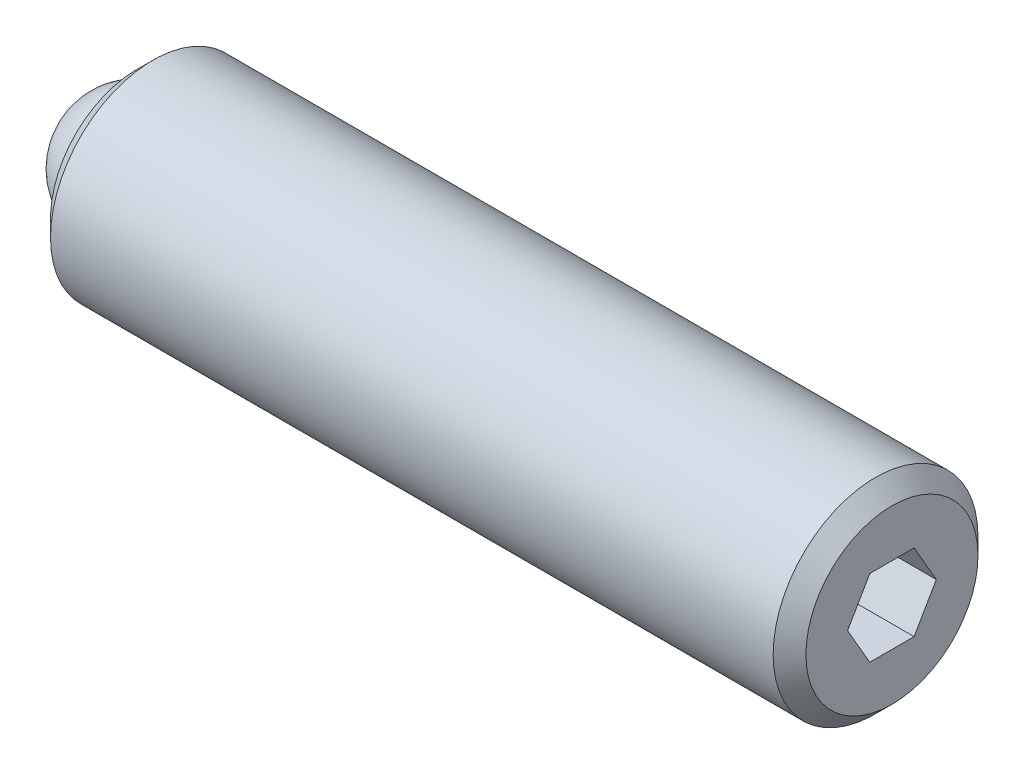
ISO-10303-21;
HEADER;
FILE_DESCRIPTION(('STEP AP214'),'2;1');
FILE_NAME('part.step','',(''),(''),'','','');
FILE_SCHEMA(('AUTOMOTIVE_DESIGN { 1 0 10303 214 1 1 1 1 }'));
ENDSEC;
DATA;
#1=APPLICATION_CONTEXT('core data for automotive mechanical design processes');
#2=APPLICATION_PROTOCOL_DEFINITION('international standard','automotive_design',2000,#1);
#3=PRODUCT_CONTEXT('',#1,'mechanical');
#4=PRODUCT('Part','Part','',(#3));
#5=PRODUCT_RELATED_PRODUCT_CATEGORY('part','',(#4));
#6=PRODUCT_DEFINITION_FORMATION('','',#4);
#7=PRODUCT_DEFINITION_CONTEXT('part definition',#1,'design');
#8=PRODUCT_DEFINITION('design','',#6,#7);
#9=PRODUCT_DEFINITION_SHAPE('','',#8);
#10=(LENGTH_UNIT() NAMED_UNIT(*) SI_UNIT(.MILLI.,.METRE.));
#11=(NAMED_UNIT(*) PLANE_ANGLE_UNIT() SI_UNIT($,.RADIAN.));
#12=(NAMED_UNIT(*) SI_UNIT($,.STERADIAN.) SOLID_ANGLE_UNIT());
#13=UNCERTAINTY_MEASURE_WITH_UNIT(LENGTH_MEASURE(1.E-05),#10,'distance_accuracy_value','');
#14=(GEOMETRIC_REPRESENTATION_CONTEXT(3) GLOBAL_UNCERTAINTY_ASSIGNED_CONTEXT((#13)) GLOBAL_UNIT_ASSIGNED_CONTEXT((#10,
#11,#12)) REPRESENTATION_CONTEXT('',''));
#15=CARTESIAN_POINT('',(0.,0.,0.));
#16=DIRECTION('',(0.,0.,1.));
#17=DIRECTION('',(1.,0.,0.));
#18=AXIS2_PLACEMENT_3D('',#15,#16,#17);
#19=CARTESIAN_POINT('',(0.,0.,0.));
#20=DIRECTION('',(0.,-1.,0.));
#21=DIRECTION('',(0.,0.,1.));
#22=AXIS2_PLACEMENT_3D('',#19,#20,#21);
#23=SPHERICAL_SURFACE('',#22,1.984375);
#24=CARTESIAN_POINT('',(0.,-1.984375,0.));
#25=VERTEX_POINT('',#24);
#26=VERTEX_LOOP('',#25);
#27=FACE_BOUND('',#26,.T.);
#28=ADVANCED_FACE('F41',(#27),#23,.T.);
#29=CLOSED_SHELL('',(#28));
#30=MANIFOLD_SOLID_BREP('B2',#29);
#31=CARTESIAN_POINT('',(23.415625,0.,0.));
#32=DIRECTION('',(-1.,0.,0.));
#33=DIRECTION('',(0.,0.,1.));
#34=AXIS2_PLACEMENT_3D('',#31,#32,#33);
#35=CYLINDRICAL_SURFACE('',#34,3.175);
#36=CARTESIAN_POINT('',(22.907625,0.,0.));
#37=DIRECTION('',(1.,0.,0.));
#38=DIRECTION('',(0.,0.,-1.));
#39=AXIS2_PLACEMENT_3D('',#36,#37,#38);
#40=CIRCLE('',#39,3.175);
#41=CARTESIAN_POINT('',(22.907625,0.,3.175));
#42=VERTEX_POINT('',#41);
#43=EDGE_CURVE('E39',#42,#42,#40,.F.);
#44=CARTESIAN_POINT('',(0.508000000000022,0.,0.));
#45=DIRECTION('',(1.,0.,0.));
#46=DIRECTION('',(0.,0.,-1.));
#47=AXIS2_PLACEMENT_3D('',#44,#45,#46);
#48=CIRCLE('',#47,3.175);
#49=CARTESIAN_POINT('',(0.508000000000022,0.,3.175));
#50=VERTEX_POINT('',#49);
#51=EDGE_CURVE('E157',#50,#50,#48,.T.);
#52=CARTESIAN_POINT('',(22.907625,0.,3.175));
#53=CARTESIAN_POINT('',(22.6742955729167,0.,3.175));
#54=CARTESIAN_POINT('',(22.4409661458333,0.,3.175));
#55=CARTESIAN_POINT('',(21.9743072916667,0.,3.175));
#56=CARTESIAN_POINT('',(21.7409778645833,0.,3.175));
#57=CARTESIAN_POINT('',(21.2743190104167,0.,3.175));
#58=CARTESIAN_POINT('',(21.0409895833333,0.,3.175));
#59=CARTESIAN_POINT('',(20.5743307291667,0.,3.175));
#60=CARTESIAN_POINT('',(20.3410013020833,0.,3.175));
#61=CARTESIAN_POINT('',(19.8743424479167,0.,3.175));
#62=CARTESIAN_POINT('',(19.6410130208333,0.,3.175));
#63=CARTESIAN_POINT('',(19.1743541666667,0.,3.175));
#64=CARTESIAN_POINT('',(18.9410247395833,0.,3.175));
#65=CARTESIAN_POINT('',(18.4743658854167,0.,3.175));
#66=CARTESIAN_POINT('',(18.2410364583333,0.,3.175));
#67=CARTESIAN_POINT('',(17.7743776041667,0.,3.175));
#68=CARTESIAN_POINT('',(17.5410481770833,0.,3.175));
#69=CARTESIAN_POINT('',(17.0743893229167,0.,3.175));
#70=CARTESIAN_POINT('',(16.8410598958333,0.,3.175));
#71=CARTESIAN_POINT('',(16.3744010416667,0.,3.175));
#72=CARTESIAN_POINT('',(16.1410716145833,0.,3.175));
#73=CARTESIAN_POINT('',(15.6744127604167,0.,3.175));
#74=CARTESIAN_POINT('',(15.4410833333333,0.,3.175));
#75=CARTESIAN_POINT('',(14.9744244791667,0.,3.175));
#76=CARTESIAN_POINT('',(14.7410950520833,0.,3.175));
#77=CARTESIAN_POINT('',(14.2744361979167,0.,3.175));
#78=CARTESIAN_POINT('',(14.0411067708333,0.,3.175));
#79=CARTESIAN_POINT('',(13.5744479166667,0.,3.175));
#80=CARTESIAN_POINT('',(13.3411184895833,0.,3.175));
#81=CARTESIAN_POINT('',(12.8744596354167,0.,3.175));
#82=CARTESIAN_POINT('',(12.6411302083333,0.,3.175));
#83=CARTESIAN_POINT('',(12.1744713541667,0.,3.175));
#84=CARTESIAN_POINT('',(11.9411419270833,0.,3.175));
#85=CARTESIAN_POINT('',(11.4744830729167,0.,3.175));
#86=CARTESIAN_POINT('',(11.2411536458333,0.,3.175));
#87=CARTESIAN_POINT('',(10.7744947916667,0.,3.175));
#88=CARTESIAN_POINT('',(10.5411653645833,0.,3.175));
#89=CARTESIAN_POINT('',(10.0745065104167,0.,3.175));
#90=CARTESIAN_POINT('',(9.84117708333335,0.,3.175));
#91=CARTESIAN_POINT('',(9.37451822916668,0.,3.175));
#92=CARTESIAN_POINT('',(9.14118880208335,0.,3.175));
#93=CARTESIAN_POINT('',(8.67452994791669,0.,3.175));
#94=CARTESIAN_POINT('',(8.44120052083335,0.,3.175));
#95=CARTESIAN_POINT('',(7.97454166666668,0.,3.175));
#96=CARTESIAN_POINT('',(7.74121223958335,0.,3.175));
#97=CARTESIAN_POINT('',(7.27455338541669,0.,3.175));
#98=CARTESIAN_POINT('',(7.04122395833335,0.,3.175));
#99=CARTESIAN_POINT('',(6.57456510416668,0.,3.175));
#100=CARTESIAN_POINT('',(6.34123567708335,0.,3.175));
#101=CARTESIAN_POINT('',(5.87457682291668,0.,3.175));
#102=CARTESIAN_POINT('',(5.64124739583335,0.,3.175));
#103=CARTESIAN_POINT('',(5.17458854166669,0.,3.175));
#104=CARTESIAN_POINT('',(4.94125911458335,0.,3.175));
#105=CARTESIAN_POINT('',(4.47460026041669,0.,3.175));
#106=CARTESIAN_POINT('',(4.24127083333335,0.,3.175));
#107=CARTESIAN_POINT('',(3.77461197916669,0.,3.175));
#108=CARTESIAN_POINT('',(3.54128255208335,0.,3.175));
#109=CARTESIAN_POINT('',(3.07462369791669,0.,3.175));
#110=CARTESIAN_POINT('',(2.84129427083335,0.,3.175));
#111=CARTESIAN_POINT('',(2.37463541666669,0.,3.175));
#112=CARTESIAN_POINT('',(2.14130598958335,0.,3.175));
#113=CARTESIAN_POINT('',(1.67464713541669,0.,3.175));
#114=CARTESIAN_POINT('',(1.44131770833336,0.,3.175));
#115=CARTESIAN_POINT('',(0.97465885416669,0.,3.175));
#116=CARTESIAN_POINT('',(0.741329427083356,0.,3.175));
#117=CARTESIAN_POINT('',(0.508000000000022,0.,3.175));
#118=B_SPLINE_CURVE_WITH_KNOTS('',3,(#52,#53,#54,#55,#56,#57,#58,#59,#60,#61,#62,#63,#64,#65,
#66,#67,#68,#69,#70,#71,#72,#73,#74,#75,#76,#77,#78,#79,#80,#81,#82,#83,#84,#85,#86,#87,#88,#89,
#90,#91,#92,#93,#94,#95,#96,#97,#98,#99,#100,#101,#102,#103,#104,#105,#106,#107,#108,#109,#110,
#111,#112,#113,#114,#115,#116,#117),.UNSPECIFIED.,.F.,.F.,(4,2,2,2,2,2,2,2,2,2,2,2,2,2,2,2,2,2,
2,2,2,2,2,2,2,2,2,2,2,2,2,2,4),(0.,0.699988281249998,1.3999765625,2.09996484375,2.799953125,
3.49994140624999,4.1999296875,4.89991796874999,5.59990624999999,6.29989453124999,
6.99988281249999,7.69987109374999,8.39985937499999,9.09984765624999,9.79983593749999,
10.49982421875,11.1998125,11.89980078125,12.5997890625,13.29977734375,13.999765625,
14.69975390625,15.3997421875,16.09973046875,16.79971875,17.49970703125,18.1996953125,
18.89968359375,19.599671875,20.29966015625,20.9996484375,21.69963671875,22.399625),.UNSPECIFIED.);
#119=EDGE_CURVE('BSEAM54',#42,#50,#118,.T.);
#120=ORIENTED_EDGE('',*,*,#43,.T.);
#121=ORIENTED_EDGE('',*,*,#51,.T.);
#122=ORIENTED_EDGE('',*,*,#119,.T.);
#123=ORIENTED_EDGE('',*,*,#119,.F.);
#124=EDGE_LOOP('',(#120,#122,#121,#123));
#125=FACE_BOUND('',#124,.T.);
#126=ADVANCED_FACE('F54',(#125),#35,.T.);
#127=CARTESIAN_POINT('',(23.415625,0.,0.));
#128=DIRECTION('',(1.,0.,0.));
#129=DIRECTION('',(0.,0.,-1.));
#130=AXIS2_PLACEMENT_3D('',#127,#128,#129);
#131=PLANE('',#130);
#132=DIRECTION('',(0.,0.866025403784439,-0.5));
#133=VECTOR('',#132,1.);
#134=CARTESIAN_POINT('',(23.415625,-1.190625,-0.687407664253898));
#135=LINE('',#134,#133);
#136=CARTESIAN_POINT('',(23.415625,-1.190625,-0.687407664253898));
#137=VERTEX_POINT('',#136);
#138=CARTESIAN_POINT('',(23.415625,0.,-1.3748153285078));
#139=VERTEX_POINT('',#138);
#140=EDGE_CURVE('E69',#137,#139,#135,.T.);
#141=ORIENTED_EDGE('',*,*,#140,.F.);
#142=DIRECTION('',(0.,0.,-1.));
#143=VECTOR('',#142,1.);
#144=CARTESIAN_POINT('',(23.415625,-1.190625,0.687407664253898));
#145=LINE('',#144,#143);
#146=CARTESIAN_POINT('',(23.415625,-1.190625,0.687407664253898));
#147=VERTEX_POINT('',#146);
#148=EDGE_CURVE('E153',#147,#137,#145,.T.);
#149=ORIENTED_EDGE('',*,*,#148,.F.);
#150=DIRECTION('',(0.,-0.866025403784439,-0.5));
#151=VECTOR('',#150,1.);
#152=CARTESIAN_POINT('',(23.415625,0.,1.3748153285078));
#153=LINE('',#152,#151);
#154=CARTESIAN_POINT('',(23.415625,0.,1.3748153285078));
#155=VERTEX_POINT('',#154);
#156=EDGE_CURVE('E151',#155,#147,#153,.T.);
#157=ORIENTED_EDGE('',*,*,#156,.F.);
#158=DIRECTION('',(0.,-0.866025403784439,0.5));
#159=VECTOR('',#158,1.);
#160=CARTESIAN_POINT('',(23.415625,1.190625,0.687407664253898));
#161=LINE('',#160,#159);
#162=CARTESIAN_POINT('',(23.415625,1.190625,0.687407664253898));
#163=VERTEX_POINT('',#162);
#164=EDGE_CURVE('E117',#163,#155,#161,.T.);
#165=ORIENTED_EDGE('',*,*,#164,.F.);
#166=DIRECTION('',(0.,0.,1.));
#167=VECTOR('',#166,1.);
#168=CARTESIAN_POINT('',(23.415625,1.190625,-0.687407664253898));
#169=LINE('',#168,#167);
#170=CARTESIAN_POINT('',(23.415625,1.190625,-0.687407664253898));
#171=VERTEX_POINT('',#170);
#172=EDGE_CURVE('E147',#171,#163,#169,.T.);
#173=ORIENTED_EDGE('',*,*,#172,.F.);
#174=DIRECTION('',(0.,0.866025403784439,0.5));
#175=VECTOR('',#174,1.);
#176=CARTESIAN_POINT('',(23.415625,0.,-1.3748153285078));
#177=LINE('',#176,#175);
#178=EDGE_CURVE('E143',#139,#171,#177,.T.);
#179=ORIENTED_EDGE('',*,*,#178,.F.);
#180=EDGE_LOOP('',(#141,#149,#157,#165,#173,#179));
#181=FACE_BOUND('',#180,.T.);
#182=CARTESIAN_POINT('',(23.415625,0.,0.));
#183=DIRECTION('',(1.,0.,0.));
#184=DIRECTION('',(0.,0.,-1.));
#185=AXIS2_PLACEMENT_3D('',#182,#183,#184);
#186=CIRCLE('',#185,2.66700000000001);
#187=CARTESIAN_POINT('',(23.415625,0.,-2.66700000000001));
#188=VERTEX_POINT('',#187);
#189=EDGE_CURVE('E62',#188,#188,#186,.T.);
#190=ORIENTED_EDGE('',*,*,#189,.T.);
#191=EDGE_LOOP('',(#190));
#192=FACE_BOUND('',#191,.T.);
#193=ADVANCED_FACE('F170',(#181,#192),#131,.T.);
#194=CARTESIAN_POINT('',(0.,0.,0.));
#195=DIRECTION('',(1.,0.,0.));
#196=DIRECTION('',(0.,0.,-1.));
#197=AXIS2_PLACEMENT_3D('',#194,#195,#196);
#198=PLANE('',#197);
#199=CARTESIAN_POINT('',(0.,0.,0.));
#200=DIRECTION('',(-1.,0.,0.));
#201=DIRECTION('',(0.,0.,1.));
#202=AXIS2_PLACEMENT_3D('',#199,#200,#201);
#203=CIRCLE('',#202,1.9812);
#204=CARTESIAN_POINT('',(0.,0.,1.9812));
#205=VERTEX_POINT('',#204);
#206=EDGE_CURVE('E225',#205,#205,#203,.T.);
#207=ORIENTED_EDGE('',*,*,#206,.F.);
#208=EDGE_LOOP('',(#207));
#209=FACE_BOUND('',#208,.T.);
#210=CARTESIAN_POINT('',(0.,0.,0.));
#211=DIRECTION('',(1.,0.,0.));
#212=DIRECTION('',(0.,0.,-1.));
#213=AXIS2_PLACEMENT_3D('',#210,#211,#212);
#214=CIRCLE('',#213,2.66699999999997);
#215=CARTESIAN_POINT('',(0.,0.,-2.66699999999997));
#216=VERTEX_POINT('',#215);
#217=EDGE_CURVE('E165',#216,#216,#214,.F.);
#218=ORIENTED_EDGE('',*,*,#217,.T.);
#219=EDGE_LOOP('',(#218));
#220=FACE_BOUND('',#219,.T.);
#221=ADVANCED_FACE('F182',(#209,#220),#198,.F.);
#222=CARTESIAN_POINT('',(0.508000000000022,0.,0.));
#223=DIRECTION('',(1.,0.,0.));
#224=DIRECTION('',(0.,0.,-1.));
#225=AXIS2_PLACEMENT_3D('',#222,#223,#224);
#226=CONICAL_SURFACE('',#225,3.175,0.785398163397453);
#227=ORIENTED_EDGE('',*,*,#217,.F.);
#228=EDGE_LOOP('',(#227));
#229=FACE_BOUND('',#228,.T.);
#230=ORIENTED_EDGE('',*,*,#51,.F.);
#231=EDGE_LOOP('',(#230));
#232=FACE_BOUND('',#231,.T.);
#233=ADVANCED_FACE('F174',(#229,#232),#226,.T.);
#234=CARTESIAN_POINT('',(23.415625,0.,0.));
#235=DIRECTION('',(-1.,0.,0.));
#236=DIRECTION('',(0.,0.,1.));
#237=AXIS2_PLACEMENT_3D('',#234,#235,#236);
#238=CONICAL_SURFACE('',#237,2.66700000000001,0.785398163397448);
#239=ORIENTED_EDGE('',*,*,#43,.F.);
#240=EDGE_LOOP('',(#239));
#241=FACE_BOUND('',#240,.T.);
#242=ORIENTED_EDGE('',*,*,#189,.F.);
#243=EDGE_LOOP('',(#242));
#244=FACE_BOUND('',#243,.T.);
#245=ADVANCED_FACE('F56',(#241,#244),#238,.T.);
#246=CARTESIAN_POINT('',(21.129625,-1.190625,-0.687407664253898));
#247=DIRECTION('',(0.,-0.5,-0.866025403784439));
#248=DIRECTION('',(0.,0.866025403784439,-0.5));
#249=AXIS2_PLACEMENT_3D('',#246,#247,#248);
#250=PLANE('',#249);
#251=ORIENTED_EDGE('',*,*,#140,.T.);
#252=DIRECTION('',(1.,0.,0.));
#253=VECTOR('',#252,1.);
#254=CARTESIAN_POINT('',(21.129625,0.,-1.3748153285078));
#255=LINE('',#254,#253);
#256=CARTESIAN_POINT('',(21.129625,0.,-1.3748153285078));
#257=VERTEX_POINT('',#256);
#258=EDGE_CURVE('E99',#257,#139,#255,.T.);
#259=ORIENTED_EDGE('',*,*,#258,.F.);
#260=DIRECTION('',(0.,0.866025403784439,-0.5));
#261=VECTOR('',#260,1.);
#262=CARTESIAN_POINT('',(21.129625,-1.190625,-0.687407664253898));
#263=LINE('',#262,#261);
#264=CARTESIAN_POINT('',(21.129625,-1.190625,-0.687407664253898));
#265=VERTEX_POINT('',#264);
#266=EDGE_CURVE('E155',#265,#257,#263,.T.);
#267=ORIENTED_EDGE('',*,*,#266,.F.);
#268=DIRECTION('',(1.,0.,0.));
#269=VECTOR('',#268,1.);
#270=CARTESIAN_POINT('',(21.129625,-1.190625,-0.687407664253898));
#271=LINE('',#270,#269);
#272=EDGE_CURVE('E77',#265,#137,#271,.T.);
#273=ORIENTED_EDGE('',*,*,#272,.T.);
#274=EDGE_LOOP('',(#251,#259,#267,#273));
#275=FACE_BOUND('',#274,.T.);
#276=ADVANCED_FACE('F173',(#275),#250,.F.);
#277=CARTESIAN_POINT('',(21.129625,-1.190625,0.687407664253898));
#278=DIRECTION('',(0.,-1.,0.));
#279=DIRECTION('',(0.,0.,-1.));
#280=AXIS2_PLACEMENT_3D('',#277,#278,#279);
#281=PLANE('',#280);
#282=ORIENTED_EDGE('',*,*,#148,.T.);
#283=ORIENTED_EDGE('',*,*,#272,.F.);
#284=DIRECTION('',(0.,0.,-1.));
#285=VECTOR('',#284,1.);
#286=CARTESIAN_POINT('',(21.129625,-1.190625,0.687407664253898));
#287=LINE('',#286,#285);
#288=CARTESIAN_POINT('',(21.129625,-1.190625,0.687407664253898));
#289=VERTEX_POINT('',#288);
#290=EDGE_CURVE('E129',#289,#265,#287,.T.);
#291=ORIENTED_EDGE('',*,*,#290,.F.);
#292=DIRECTION('',(1.,0.,0.));
#293=VECTOR('',#292,1.);
#294=CARTESIAN_POINT('',(21.129625,-1.190625,0.687407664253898));
#295=LINE('',#294,#293);
#296=EDGE_CURVE('E121',#289,#147,#295,.T.);
#297=ORIENTED_EDGE('',*,*,#296,.T.);
#298=EDGE_LOOP('',(#282,#283,#291,#297));
#299=FACE_BOUND('',#298,.T.);
#300=ADVANCED_FACE('F180',(#299),#281,.F.);
#301=CARTESIAN_POINT('',(21.129625,0.,1.3748153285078));
#302=DIRECTION('',(0.,-0.5,0.866025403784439));
#303=DIRECTION('',(0.,-0.866025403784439,-0.5));
#304=AXIS2_PLACEMENT_3D('',#301,#302,#303);
#305=PLANE('',#304);
#306=ORIENTED_EDGE('',*,*,#156,.T.);
#307=ORIENTED_EDGE('',*,*,#296,.F.);
#308=DIRECTION('',(0.,-0.866025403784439,-0.5));
#309=VECTOR('',#308,1.);
#310=CARTESIAN_POINT('',(21.129625,0.,1.3748153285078));
#311=LINE('',#310,#309);
#312=CARTESIAN_POINT('',(21.129625,0.,1.3748153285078));
#313=VERTEX_POINT('',#312);
#314=EDGE_CURVE('E125',#313,#289,#311,.T.);
#315=ORIENTED_EDGE('',*,*,#314,.F.);
#316=DIRECTION('',(1.,0.,0.));
#317=VECTOR('',#316,1.);
#318=CARTESIAN_POINT('',(21.129625,0.,1.3748153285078));
#319=LINE('',#318,#317);
#320=EDGE_CURVE('E110',#313,#155,#319,.T.);
#321=ORIENTED_EDGE('',*,*,#320,.T.);
#322=EDGE_LOOP('',(#306,#307,#315,#321));
#323=FACE_BOUND('',#322,.T.);
#324=ADVANCED_FACE('F126',(#323),#305,.F.);
#325=CARTESIAN_POINT('',(21.129625,1.190625,0.687407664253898));
#326=DIRECTION('',(0.,0.5,0.866025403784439));
#327=DIRECTION('',(0.,-0.866025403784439,0.5));
#328=AXIS2_PLACEMENT_3D('',#325,#326,#327);
#329=PLANE('',#328);
#330=ORIENTED_EDGE('',*,*,#164,.T.);
#331=ORIENTED_EDGE('',*,*,#320,.F.);
#332=DIRECTION('',(0.,-0.866025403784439,0.5));
#333=VECTOR('',#332,1.);
#334=CARTESIAN_POINT('',(21.129625,1.190625,0.687407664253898));
#335=LINE('',#334,#333);
#336=CARTESIAN_POINT('',(21.129625,1.190625,0.687407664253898));
#337=VERTEX_POINT('',#336);
#338=EDGE_CURVE('E114',#337,#313,#335,.T.);
#339=ORIENTED_EDGE('',*,*,#338,.F.);
#340=DIRECTION('',(1.,0.,0.));
#341=VECTOR('',#340,1.);
#342=CARTESIAN_POINT('',(21.129625,1.190625,0.687407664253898));
#343=LINE('',#342,#341);
#344=EDGE_CURVE('E122',#337,#163,#343,.T.);
#345=ORIENTED_EDGE('',*,*,#344,.T.);
#346=EDGE_LOOP('',(#330,#331,#339,#345));
#347=FACE_BOUND('',#346,.T.);
#348=ADVANCED_FACE('F112',(#347),#329,.F.);
#349=CARTESIAN_POINT('',(21.129625,1.190625,-0.687407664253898));
#350=DIRECTION('',(0.,1.,0.));
#351=DIRECTION('',(0.,0.,1.));
#352=AXIS2_PLACEMENT_3D('',#349,#350,#351);
#353=PLANE('',#352);
#354=ORIENTED_EDGE('',*,*,#172,.T.);
#355=ORIENTED_EDGE('',*,*,#344,.F.);
#356=DIRECTION('',(0.,0.,1.));
#357=VECTOR('',#356,1.);
#358=CARTESIAN_POINT('',(21.129625,1.190625,-0.687407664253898));
#359=LINE('',#358,#357);
#360=CARTESIAN_POINT('',(21.129625,1.190625,-0.687407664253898));
#361=VERTEX_POINT('',#360);
#362=EDGE_CURVE('E135',#361,#337,#359,.T.);
#363=ORIENTED_EDGE('',*,*,#362,.F.);
#364=DIRECTION('',(1.,0.,0.));
#365=VECTOR('',#364,1.);
#366=CARTESIAN_POINT('',(21.129625,1.190625,-0.687407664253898));
#367=LINE('',#366,#365);
#368=EDGE_CURVE('E160',#361,#171,#367,.T.);
#369=ORIENTED_EDGE('',*,*,#368,.T.);
#370=EDGE_LOOP('',(#354,#355,#363,#369));
#371=FACE_BOUND('',#370,.T.);
#372=ADVANCED_FACE('F201',(#371),#353,.F.);
#373=CARTESIAN_POINT('',(21.129625,0.,-1.3748153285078));
#374=DIRECTION('',(0.,0.5,-0.866025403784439));
#375=DIRECTION('',(0.,0.866025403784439,0.5));
#376=AXIS2_PLACEMENT_3D('',#373,#374,#375);
#377=PLANE('',#376);
#378=ORIENTED_EDGE('',*,*,#178,.T.);
#379=ORIENTED_EDGE('',*,*,#368,.F.);
#380=DIRECTION('',(0.,0.866025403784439,0.5));
#381=VECTOR('',#380,1.);
#382=CARTESIAN_POINT('',(21.129625,0.,-1.3748153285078));
#383=LINE('',#382,#381);
#384=EDGE_CURVE('E137',#257,#361,#383,.T.);
#385=ORIENTED_EDGE('',*,*,#384,.F.);
#386=ORIENTED_EDGE('',*,*,#258,.T.);
#387=EDGE_LOOP('',(#378,#379,#385,#386));
#388=FACE_BOUND('',#387,.T.);
#389=ADVANCED_FACE('F198',(#388),#377,.F.);
#390=CARTESIAN_POINT('',(21.129625,0.,0.));
#391=DIRECTION('',(1.,0.,0.));
#392=DIRECTION('',(0.,0.,-1.));
#393=AXIS2_PLACEMENT_3D('',#390,#391,#392);
#394=PLANE('',#393);
#395=ORIENTED_EDGE('',*,*,#266,.T.);
#396=ORIENTED_EDGE('',*,*,#384,.T.);
#397=ORIENTED_EDGE('',*,*,#362,.T.);
#398=ORIENTED_EDGE('',*,*,#338,.T.);
#399=ORIENTED_EDGE('',*,*,#314,.T.);
#400=ORIENTED_EDGE('',*,*,#290,.T.);
#401=EDGE_LOOP('',(#395,#396,#397,#398,#399,#400));
#402=FACE_BOUND('',#401,.T.);
#403=ADVANCED_FACE('F132',(#402),#394,.T.);
#404=CARTESIAN_POINT('',(1.984375,0.,0.));
#405=DIRECTION('',(-1.,0.,0.));
#406=DIRECTION('',(0.,0.,1.));
#407=AXIS2_PLACEMENT_3D('',#404,#405,#406);
#408=CYLINDRICAL_SURFACE('',#407,1.9812);
#409=CARTESIAN_POINT('',(1.984375,0.,0.));
#410=DIRECTION('',(-1.,0.,0.));
#411=DIRECTION('',(0.,0.,1.));
#412=AXIS2_PLACEMENT_3D('',#409,#410,#411);
#413=CIRCLE('',#412,1.9812);
#414=CARTESIAN_POINT('',(1.984375,0.,1.9812));
#415=VERTEX_POINT('',#414);
#416=EDGE_CURVE('E144',#415,#415,#413,.T.);
#417=ORIENTED_EDGE('',*,*,#416,.F.);
#418=EDGE_LOOP('',(#417));
#419=FACE_BOUND('',#418,.T.);
#420=ORIENTED_EDGE('',*,*,#206,.T.);
#421=EDGE_LOOP('',(#420));
#422=FACE_BOUND('',#421,.T.);
#423=ADVANCED_FACE('F214',(#419,#422),#408,.F.);
#424=CARTESIAN_POINT('',(1.984375,0.,0.));
#425=DIRECTION('',(-1.,0.,0.));
#426=DIRECTION('',(0.,0.,1.));
#427=AXIS2_PLACEMENT_3D('',#424,#425,#426);
#428=PLANE('',#427);
#429=ORIENTED_EDGE('',*,*,#416,.T.);
#430=EDGE_LOOP('',(#429));
#431=FACE_BOUND('',#430,.T.);
#432=ADVANCED_FACE('F217',(#431),#428,.T.);
#433=CLOSED_SHELL('',(#126,#193,#221,#233,#245,#276,#300,#324,#348,#372,#389,#403,#423,#432));
#434=MANIFOLD_SOLID_BREP('B6',#433);
#435=ADVANCED_BREP_SHAPE_REPRESENTATION('',(#18,#30,#434),#14);
#436=SHAPE_DEFINITION_REPRESENTATION(#9,#435);
ENDSEC;
END-ISO-10303-21;
